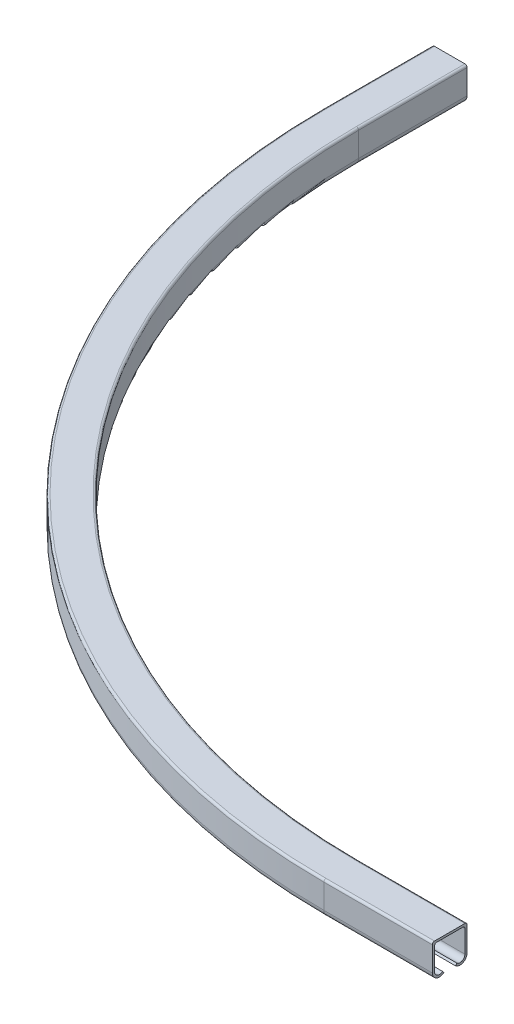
from build123d import *

# Parameters (mm, degrees)
FILLET1_R = 2


with BuildPart() as part:
    # Sweep1: sweep along a path in Sketch2
    with BuildLine(Plane(origin=(0, 0, 0), x_dir=(1, 0, 0), z_dir=(0, 1, 0))) as sweep1_path:
        Line((0, 100), (0, 0))
        ThreePointArc((0, 0), (175.735931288, -424.264068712), (600, -600))
        Line((600, -600), (700, -600))
    # Sketch1 → Sweep1 (sweep)
    with BuildSketch(Plane.XY.offset(-100)):
        with BuildLine():
            Line((0, 0), (-16, 0))
            Line((-16, 0), (-16, -24.5))
            ThreePointArc((-16, -24.5), (-12.234044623, -30.397033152), (-5.3, -29.460846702))
            Line((-5.3, -29.460846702), (-6.592307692, -27.934432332))
            ThreePointArc((-6.592307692, -27.934432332), (-11.392800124, -28.582561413), (-14, -24.5))
            Line((-14, -24.5), (-14, -2))
            Line((-14, -2), (0, -2))
            Line((0, -2), (14, -2))
            Line((14, -2), (14, -24.5))
            ThreePointArc((14, -24.5), (11.392800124, -28.582561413), (6.592307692, -27.934432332))
            Line((6.592307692, -27.934432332), (5.3, -29.460846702))
            ThreePointArc((5.3, -29.460846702), (12.234044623, -30.397033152), (16, -24.5))
            Line((16, -24.5), (16, 0))
            Line((16, 0), (0, 0))
        make_face()
    sweep(path=sweep1_path.line)

    # Fillet1
    fillet1_edges = [part.edges().sort_by_distance(p)[0] for p in [
        (-16, 0, -50),
        (16, 0, -50),
        (14, -2, -50),
        (-14, -2, -50),
        (164.422222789, 0, 435.577777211),
        (187.049639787, 0, 412.950360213),
        (185.635426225, -2, 414.364573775),
        (165.836436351, -2, 434.163563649),
        (650, 0, 616),
        (650, 0, 584),
        (650, -2, 586),
        (650, -2, 614),
    ]]
    fillet(fillet1_edges, radius=FILLET1_R)


solid = part.part
